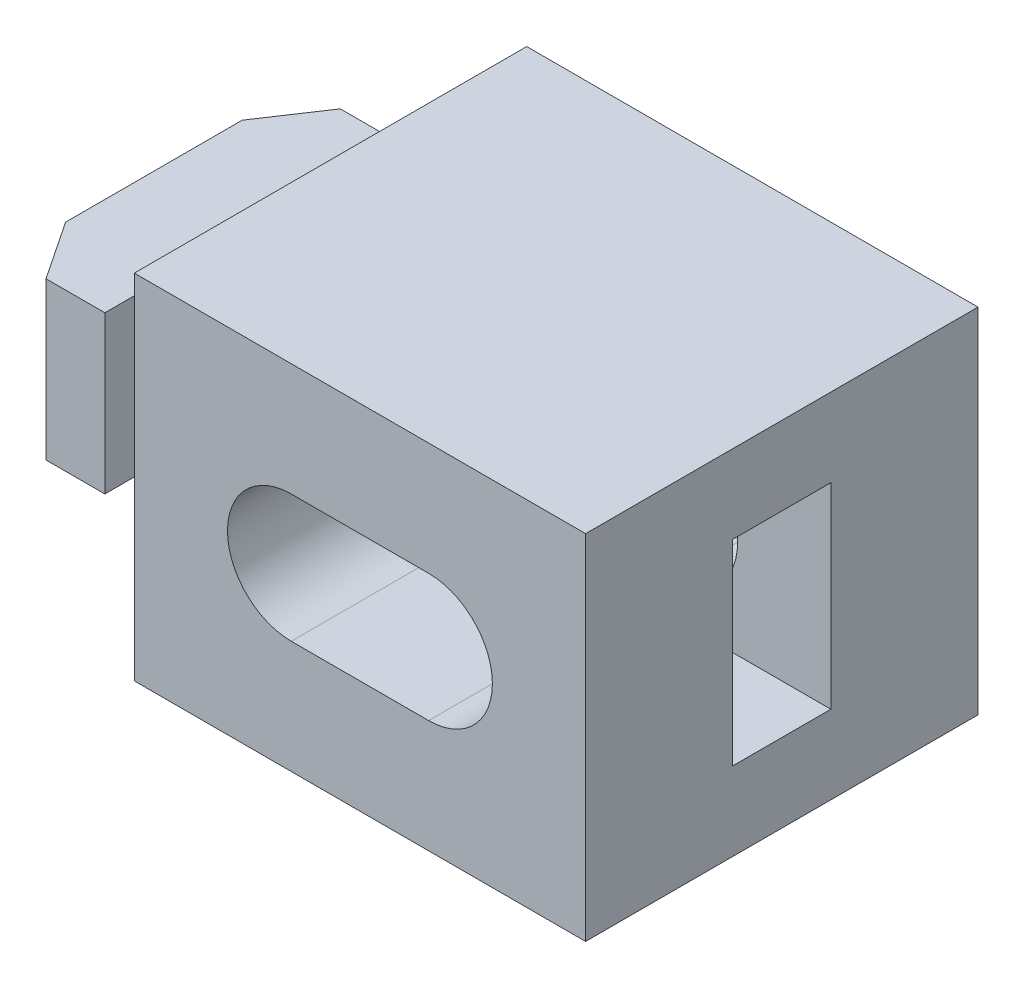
ISO-10303-21;
HEADER;
FILE_DESCRIPTION(('STEP AP214'),'2;1');
FILE_NAME('part.step','',(''),(''),'','','');
FILE_SCHEMA(('AUTOMOTIVE_DESIGN { 1 0 10303 214 1 1 1 1 }'));
ENDSEC;
DATA;
#1=APPLICATION_CONTEXT('core data for automotive mechanical design processes');
#2=APPLICATION_PROTOCOL_DEFINITION('international standard','automotive_design',2000,#1);
#3=PRODUCT_CONTEXT('',#1,'mechanical');
#4=PRODUCT('Part','Part','',(#3));
#5=PRODUCT_RELATED_PRODUCT_CATEGORY('part','',(#4));
#6=PRODUCT_DEFINITION_FORMATION('','',#4);
#7=PRODUCT_DEFINITION_CONTEXT('part definition',#1,'design');
#8=PRODUCT_DEFINITION('design','',#6,#7);
#9=PRODUCT_DEFINITION_SHAPE('','',#8);
#10=(LENGTH_UNIT() NAMED_UNIT(*) SI_UNIT(.MILLI.,.METRE.));
#11=(NAMED_UNIT(*) PLANE_ANGLE_UNIT() SI_UNIT($,.RADIAN.));
#12=(NAMED_UNIT(*) SI_UNIT($,.STERADIAN.) SOLID_ANGLE_UNIT());
#13=UNCERTAINTY_MEASURE_WITH_UNIT(LENGTH_MEASURE(1.E-05),#10,'distance_accuracy_value','');
#14=(GEOMETRIC_REPRESENTATION_CONTEXT(3) GLOBAL_UNCERTAINTY_ASSIGNED_CONTEXT((#13)) GLOBAL_UNIT_ASSIGNED_CONTEXT((#10,
#11,#12)) REPRESENTATION_CONTEXT('',''));
#15=CARTESIAN_POINT('',(0.,0.,0.));
#16=DIRECTION('',(0.,0.,1.));
#17=DIRECTION('',(1.,0.,0.));
#18=AXIS2_PLACEMENT_3D('',#15,#16,#17);
#19=CARTESIAN_POINT('',(-20.5,-4.,-7.5));
#20=DIRECTION('',(0.,1.,0.));
#21=DIRECTION('',(-1.,0.,0.));
#22=AXIS2_PLACEMENT_3D('',#19,#20,#21);
#23=PLANE('',#22);
#24=DIRECTION('',(0.55470019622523,0.,-0.832050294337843));
#25=VECTOR('',#24,1.);
#26=CARTESIAN_POINT('',(-20.5,-4.,-4.5));
#27=LINE('',#26,#25);
#28=CARTESIAN_POINT('',(-20.5,-4.,-4.5));
#29=VERTEX_POINT('',#28);
#30=CARTESIAN_POINT('',(-18.5,-4.,-7.5));
#31=VERTEX_POINT('',#30);
#32=EDGE_CURVE('E49',#29,#31,#27,.T.);
#33=ORIENTED_EDGE('',*,*,#32,.T.);
#34=DIRECTION('',(1.,0.,0.));
#35=VECTOR('',#34,1.);
#36=CARTESIAN_POINT('',(-20.5,-4.,-7.5));
#37=LINE('',#36,#35);
#38=CARTESIAN_POINT('',(-15.5,-4.,-7.5));
#39=VERTEX_POINT('',#38);
#40=EDGE_CURVE('E227',#31,#39,#37,.T.);
#41=ORIENTED_EDGE('',*,*,#40,.T.);
#42=DIRECTION('',(0.,0.,1.));
#43=VECTOR('',#42,1.);
#44=CARTESIAN_POINT('',(-15.5,-4.,-7.5));
#45=LINE('',#44,#43);
#46=CARTESIAN_POINT('',(-15.5,-4.,-0.999999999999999));
#47=VERTEX_POINT('',#46);
#48=EDGE_CURVE('E393',#39,#47,#45,.T.);
#49=ORIENTED_EDGE('',*,*,#48,.T.);
#50=DIRECTION('',(-1.,0.,0.));
#51=VECTOR('',#50,1.);
#52=CARTESIAN_POINT('',(-20.5,-4.,-0.999999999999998));
#53=LINE('',#52,#51);
#54=CARTESIAN_POINT('',(-11.5,-4.,-1.));
#55=VERTEX_POINT('',#54);
#56=EDGE_CURVE('E365',#47,#55,#53,.F.);
#57=ORIENTED_EDGE('',*,*,#56,.T.);
#58=DIRECTION('',(0.,0.,1.));
#59=VECTOR('',#58,1.);
#60=CARTESIAN_POINT('',(-11.5,-4.,-7.5));
#61=LINE('',#60,#59);
#62=CARTESIAN_POINT('',(-11.5,-4.,4.));
#63=VERTEX_POINT('',#62);
#64=EDGE_CURVE('E422',#55,#63,#61,.T.);
#65=ORIENTED_EDGE('',*,*,#64,.T.);
#66=DIRECTION('',(-1.,0.,0.));
#67=VECTOR('',#66,1.);
#68=CARTESIAN_POINT('',(-11.5,-4.,4.));
#69=LINE('',#68,#67);
#70=CARTESIAN_POINT('',(-15.5,-4.,4.));
#71=VERTEX_POINT('',#70);
#72=EDGE_CURVE('E408',#63,#71,#69,.T.);
#73=ORIENTED_EDGE('',*,*,#72,.T.);
#74=DIRECTION('',(0.,0.,-1.));
#75=VECTOR('',#74,1.);
#76=CARTESIAN_POINT('',(-15.5,-4.,7.5));
#77=LINE('',#76,#75);
#78=CARTESIAN_POINT('',(-15.5,-4.,7.5));
#79=VERTEX_POINT('',#78);
#80=EDGE_CURVE('E411',#79,#71,#77,.T.);
#81=ORIENTED_EDGE('',*,*,#80,.F.);
#82=DIRECTION('',(1.,0.,0.));
#83=VECTOR('',#82,1.);
#84=CARTESIAN_POINT('',(-20.5,-4.,7.5));
#85=LINE('',#84,#83);
#86=CARTESIAN_POINT('',(-18.5,-4.,7.5));
#87=VERTEX_POINT('',#86);
#88=EDGE_CURVE('E237',#87,#79,#85,.T.);
#89=ORIENTED_EDGE('',*,*,#88,.F.);
#90=DIRECTION('',(0.55470019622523,0.,0.832050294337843));
#91=VECTOR('',#90,1.);
#92=CARTESIAN_POINT('',(-20.5,-4.,4.5));
#93=LINE('',#92,#91);
#94=CARTESIAN_POINT('',(-20.5,-4.,4.5));
#95=VERTEX_POINT('',#94);
#96=EDGE_CURVE('E377',#95,#87,#93,.T.);
#97=ORIENTED_EDGE('',*,*,#96,.F.);
#98=DIRECTION('',(0.,0.,1.));
#99=VECTOR('',#98,1.);
#100=CARTESIAN_POINT('',(-20.5,-4.,-7.5));
#101=LINE('',#100,#99);
#102=EDGE_CURVE('E230',#29,#95,#101,.T.);
#103=ORIENTED_EDGE('',*,*,#102,.F.);
#104=EDGE_LOOP('',(#33,#41,#49,#57,#65,#73,#81,#89,#97,#103));
#105=FACE_BOUND('',#104,.T.);
#106=ADVANCED_FACE('F34',(#105),#23,.F.);
#107=CARTESIAN_POINT('',(-20.5,4.,-7.5));
#108=DIRECTION('',(0.,-1.,0.));
#109=DIRECTION('',(1.,0.,0.));
#110=AXIS2_PLACEMENT_3D('',#107,#108,#109);
#111=PLANE('',#110);
#112=DIRECTION('',(0.55470019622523,0.,-0.832050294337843));
#113=VECTOR('',#112,1.);
#114=CARTESIAN_POINT('',(-19.1153846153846,4.,-6.57692307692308));
#115=LINE('',#114,#113);
#116=CARTESIAN_POINT('',(-20.5,4.,-4.5));
#117=VERTEX_POINT('',#116);
#118=CARTESIAN_POINT('',(-18.5,4.,-7.5));
#119=VERTEX_POINT('',#118);
#120=EDGE_CURVE('E220',#117,#119,#115,.T.);
#121=ORIENTED_EDGE('',*,*,#120,.F.);
#122=DIRECTION('',(0.,0.,-1.));
#123=VECTOR('',#122,1.);
#124=CARTESIAN_POINT('',(-20.5,4.,-7.5));
#125=LINE('',#124,#123);
#126=CARTESIAN_POINT('',(-20.5,3.99999999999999,4.5));
#127=VERTEX_POINT('',#126);
#128=EDGE_CURVE('E424',#127,#117,#125,.T.);
#129=ORIENTED_EDGE('',*,*,#128,.F.);
#130=DIRECTION('',(0.55470019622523,0.,0.832050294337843));
#131=VECTOR('',#130,1.);
#132=CARTESIAN_POINT('',(-26.0384615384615,3.99999999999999,-3.8076923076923));
#133=LINE('',#132,#131);
#134=CARTESIAN_POINT('',(-18.5,4.,7.5));
#135=VERTEX_POINT('',#134);
#136=EDGE_CURVE('E56',#127,#135,#133,.T.);
#137=ORIENTED_EDGE('',*,*,#136,.T.);
#138=DIRECTION('',(1.,0.,0.));
#139=VECTOR('',#138,1.);
#140=CARTESIAN_POINT('',(-20.5,3.99999999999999,7.5));
#141=LINE('',#140,#139);
#142=CARTESIAN_POINT('',(-15.5,4.,7.5));
#143=VERTEX_POINT('',#142);
#144=EDGE_CURVE('E241',#135,#143,#141,.T.);
#145=ORIENTED_EDGE('',*,*,#144,.T.);
#146=DIRECTION('',(0.,0.,1.));
#147=VECTOR('',#146,1.);
#148=CARTESIAN_POINT('',(-15.5,4.,7.5));
#149=LINE('',#148,#147);
#150=CARTESIAN_POINT('',(-15.5,4.,1.));
#151=VERTEX_POINT('',#150);
#152=EDGE_CURVE('E405',#151,#143,#149,.T.);
#153=ORIENTED_EDGE('',*,*,#152,.F.);
#154=DIRECTION('',(1.,0.,0.));
#155=VECTOR('',#154,1.);
#156=CARTESIAN_POINT('',(-11.5,4.,1.));
#157=LINE('',#156,#155);
#158=CARTESIAN_POINT('',(-11.5,4.,1.));
#159=VERTEX_POINT('',#158);
#160=EDGE_CURVE('E357',#151,#159,#157,.T.);
#161=ORIENTED_EDGE('',*,*,#160,.T.);
#162=DIRECTION('',(0.,0.,-1.));
#163=VECTOR('',#162,1.);
#164=CARTESIAN_POINT('',(-11.5,4.,-7.5));
#165=LINE('',#164,#163);
#166=CARTESIAN_POINT('',(-11.5,4.,-4.));
#167=VERTEX_POINT('',#166);
#168=EDGE_CURVE('E425',#159,#167,#165,.T.);
#169=ORIENTED_EDGE('',*,*,#168,.T.);
#170=DIRECTION('',(1.,0.,0.));
#171=VECTOR('',#170,1.);
#172=CARTESIAN_POINT('',(-11.5,4.,-4.));
#173=LINE('',#172,#171);
#174=CARTESIAN_POINT('',(-15.5,4.,-4.));
#175=VERTEX_POINT('',#174);
#176=EDGE_CURVE('E402',#175,#167,#173,.T.);
#177=ORIENTED_EDGE('',*,*,#176,.F.);
#178=DIRECTION('',(0.,0.,-1.));
#179=VECTOR('',#178,1.);
#180=CARTESIAN_POINT('',(-15.5,4.,-7.5));
#181=LINE('',#180,#179);
#182=CARTESIAN_POINT('',(-15.5,4.,-7.5));
#183=VERTEX_POINT('',#182);
#184=EDGE_CURVE('E390',#175,#183,#181,.T.);
#185=ORIENTED_EDGE('',*,*,#184,.T.);
#186=DIRECTION('',(1.,0.,0.));
#187=VECTOR('',#186,1.);
#188=CARTESIAN_POINT('',(-20.5,4.,-7.5));
#189=LINE('',#188,#187);
#190=EDGE_CURVE('E427',#119,#183,#189,.T.);
#191=ORIENTED_EDGE('',*,*,#190,.F.);
#192=EDGE_LOOP('',(#121,#129,#137,#145,#153,#161,#169,#177,#185,#191));
#193=FACE_BOUND('',#192,.T.);
#194=ADVANCED_FACE('F432',(#193),#111,.F.);
#195=CARTESIAN_POINT('',(-20.5,4.,-7.5));
#196=DIRECTION('',(0.,0.,1.));
#197=DIRECTION('',(0.,-1.,0.));
#198=AXIS2_PLACEMENT_3D('',#195,#196,#197);
#199=PLANE('',#198);
#200=DIRECTION('',(0.,-1.,0.));
#201=VECTOR('',#200,1.);
#202=CARTESIAN_POINT('',(-18.5,5.,-7.5));
#203=LINE('',#202,#201);
#204=EDGE_CURVE('E217',#119,#31,#203,.T.);
#205=ORIENTED_EDGE('',*,*,#204,.F.);
#206=ORIENTED_EDGE('',*,*,#190,.T.);
#207=DIRECTION('',(0.,-1.,0.));
#208=VECTOR('',#207,1.);
#209=CARTESIAN_POINT('',(-15.5,9.001,-7.5));
#210=LINE('',#209,#208);
#211=EDGE_CURVE('E235',#183,#39,#210,.T.);
#212=ORIENTED_EDGE('',*,*,#211,.T.);
#213=ORIENTED_EDGE('',*,*,#40,.F.);
#214=EDGE_LOOP('',(#205,#206,#212,#213));
#215=FACE_BOUND('',#214,.T.);
#216=ADVANCED_FACE('F233',(#215),#199,.F.);
#217=CARTESIAN_POINT('',(-20.5,0.,0.));
#218=DIRECTION('',(-1.,0.,0.));
#219=DIRECTION('',(0.,0.,1.));
#220=AXIS2_PLACEMENT_3D('',#217,#218,#219);
#221=PLANE('',#220);
#222=ORIENTED_EDGE('',*,*,#128,.T.);
#223=DIRECTION('',(0.,-1.,0.));
#224=VECTOR('',#223,1.);
#225=CARTESIAN_POINT('',(-20.5,0.,-4.5));
#226=LINE('',#225,#224);
#227=EDGE_CURVE('E11',#117,#29,#226,.T.);
#228=ORIENTED_EDGE('',*,*,#227,.T.);
#229=ORIENTED_EDGE('',*,*,#102,.T.);
#230=DIRECTION('',(0.,-1.,0.));
#231=VECTOR('',#230,1.);
#232=CARTESIAN_POINT('',(-20.5,0.,4.5));
#233=LINE('',#232,#231);
#234=EDGE_CURVE('E42',#127,#95,#233,.T.);
#235=ORIENTED_EDGE('',*,*,#234,.F.);
#236=EDGE_LOOP('',(#222,#228,#229,#235));
#237=FACE_BOUND('',#236,.T.);
#238=ADVANCED_FACE('F462',(#237),#221,.T.);
#239=CARTESIAN_POINT('',(-11.5,9.,10.));
#240=DIRECTION('',(1.,0.,0.));
#241=DIRECTION('',(0.,1.,0.));
#242=AXIS2_PLACEMENT_3D('',#239,#240,#241);
#243=PLANE('',#242);
#244=ORIENTED_EDGE('',*,*,#64,.F.);
#245=CARTESIAN_POINT('',(-11.5,-1.,-1.));
#246=DIRECTION('',(1.,0.,0.));
#247=DIRECTION('',(0.,1.,0.));
#248=AXIS2_PLACEMENT_3D('',#245,#246,#247);
#249=CIRCLE('',#248,3.);
#250=CARTESIAN_POINT('',(-11.5,-1.,-4.));
#251=VERTEX_POINT('',#250);
#252=EDGE_CURVE('E375',#55,#251,#249,.T.);
#253=ORIENTED_EDGE('',*,*,#252,.T.);
#254=DIRECTION('',(0.,-1.,0.));
#255=VECTOR('',#254,1.);
#256=CARTESIAN_POINT('',(-11.5,9.001,-4.));
#257=LINE('',#256,#255);
#258=EDGE_CURVE('E395',#167,#251,#257,.T.);
#259=ORIENTED_EDGE('',*,*,#258,.F.);
#260=ORIENTED_EDGE('',*,*,#168,.F.);
#261=CARTESIAN_POINT('',(-11.5,0.999999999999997,1.));
#262=DIRECTION('',(1.,0.,0.));
#263=DIRECTION('',(0.,1.,0.));
#264=AXIS2_PLACEMENT_3D('',#261,#262,#263);
#265=CIRCLE('',#264,3.);
#266=CARTESIAN_POINT('',(-11.5,0.999999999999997,4.));
#267=VERTEX_POINT('',#266);
#268=EDGE_CURVE('E367',#159,#267,#265,.T.);
#269=ORIENTED_EDGE('',*,*,#268,.T.);
#270=DIRECTION('',(0.,-1.,0.));
#271=VECTOR('',#270,1.);
#272=CARTESIAN_POINT('',(-11.5,9.001,4.));
#273=LINE('',#272,#271);
#274=EDGE_CURVE('E419',#267,#63,#273,.T.);
#275=ORIENTED_EDGE('',*,*,#274,.T.);
#276=EDGE_LOOP('',(#244,#253,#259,#260,#269,#275));
#277=FACE_BOUND('',#276,.T.);
#278=DIRECTION('',(0.,-1.,0.));
#279=VECTOR('',#278,1.);
#280=CARTESIAN_POINT('',(-11.5,9.,-10.));
#281=LINE('',#280,#279);
#282=CARTESIAN_POINT('',(-11.5,9.,-10.));
#283=VERTEX_POINT('',#282);
#284=CARTESIAN_POINT('',(-11.5,-9.,-10.));
#285=VERTEX_POINT('',#284);
#286=EDGE_CURVE('E323',#283,#285,#281,.T.);
#287=ORIENTED_EDGE('',*,*,#286,.T.);
#288=DIRECTION('',(0.,0.,-1.));
#289=VECTOR('',#288,1.);
#290=CARTESIAN_POINT('',(-11.5,-9.,10.));
#291=LINE('',#290,#289);
#292=CARTESIAN_POINT('',(-11.5,-9.,10.));
#293=VERTEX_POINT('',#292);
#294=EDGE_CURVE('E350',#293,#285,#291,.T.);
#295=ORIENTED_EDGE('',*,*,#294,.F.);
#296=DIRECTION('',(0.,-1.,0.));
#297=VECTOR('',#296,1.);
#298=CARTESIAN_POINT('',(-11.5,9.,10.));
#299=LINE('',#298,#297);
#300=CARTESIAN_POINT('',(-11.5,9.,10.));
#301=VERTEX_POINT('',#300);
#302=EDGE_CURVE('E324',#301,#293,#299,.T.);
#303=ORIENTED_EDGE('',*,*,#302,.F.);
#304=DIRECTION('',(0.,0.,-1.));
#305=VECTOR('',#304,1.);
#306=CARTESIAN_POINT('',(-11.5,9.,10.));
#307=LINE('',#306,#305);
#308=EDGE_CURVE('E334',#301,#283,#307,.T.);
#309=ORIENTED_EDGE('',*,*,#308,.T.);
#310=EDGE_LOOP('',(#287,#295,#303,#309));
#311=FACE_BOUND('',#310,.T.);
#312=ADVANCED_FACE('F519',(#277,#311),#243,.F.);
#313=CARTESIAN_POINT('',(-3.5,0.,10.));
#314=DIRECTION('',(0.,0.,-1.));
#315=DIRECTION('',(-1.,0.,0.));
#316=AXIS2_PLACEMENT_3D('',#313,#314,#315);
#317=CYLINDRICAL_SURFACE('',#316,3.25);
#318=CARTESIAN_POINT('',(-3.5,0.,2.5));
#319=DIRECTION('',(0.,0.,1.));
#320=DIRECTION('',(0.,-1.,0.));
#321=AXIS2_PLACEMENT_3D('',#318,#319,#320);
#322=CIRCLE('',#321,3.25);
#323=CARTESIAN_POINT('',(-3.5,3.25,2.5));
#324=VERTEX_POINT('',#323);
#325=CARTESIAN_POINT('',(-3.5,-3.25,2.5));
#326=VERTEX_POINT('',#325);
#327=EDGE_CURVE('E284',#324,#326,#322,.T.);
#328=ORIENTED_EDGE('',*,*,#327,.F.);
#329=DIRECTION('',(0.,0.,-1.));
#330=VECTOR('',#329,1.);
#331=CARTESIAN_POINT('',(-3.5,3.25,10.));
#332=LINE('',#331,#330);
#333=CARTESIAN_POINT('',(-3.5,3.25,10.));
#334=VERTEX_POINT('',#333);
#335=EDGE_CURVE('E308',#334,#324,#332,.T.);
#336=ORIENTED_EDGE('',*,*,#335,.F.);
#337=CARTESIAN_POINT('',(-3.5,0.,10.));
#338=DIRECTION('',(0.,0.,1.));
#339=DIRECTION('',(1.,0.,0.));
#340=AXIS2_PLACEMENT_3D('',#337,#338,#339);
#341=CIRCLE('',#340,3.25);
#342=CARTESIAN_POINT('',(-3.5,-3.25,10.));
#343=VERTEX_POINT('',#342);
#344=EDGE_CURVE('E287',#334,#343,#341,.T.);
#345=ORIENTED_EDGE('',*,*,#344,.T.);
#346=DIRECTION('',(0.,0.,-1.));
#347=VECTOR('',#346,1.);
#348=CARTESIAN_POINT('',(-3.5,-3.25,10.));
#349=LINE('',#348,#347);
#350=EDGE_CURVE('E320',#343,#326,#349,.T.);
#351=ORIENTED_EDGE('',*,*,#350,.T.);
#352=EDGE_LOOP('',(#328,#336,#345,#351));
#353=FACE_BOUND('',#352,.T.);
#354=ADVANCED_FACE('F499',(#353),#317,.F.);
#355=CARTESIAN_POINT('',(-3.5,-3.25,10.));
#356=DIRECTION('',(0.,1.,0.));
#357=DIRECTION('',(-1.,0.,0.));
#358=AXIS2_PLACEMENT_3D('',#355,#356,#357);
#359=PLANE('',#358);
#360=DIRECTION('',(1.,0.,0.));
#361=VECTOR('',#360,1.);
#362=CARTESIAN_POINT('',(-3.5,-3.25,2.5));
#363=LINE('',#362,#361);
#364=CARTESIAN_POINT('',(3.5,-3.25,2.5));
#365=VERTEX_POINT('',#364);
#366=EDGE_CURVE('E282',#326,#365,#363,.T.);
#367=ORIENTED_EDGE('',*,*,#366,.F.);
#368=ORIENTED_EDGE('',*,*,#350,.F.);
#369=DIRECTION('',(1.,0.,0.));
#370=VECTOR('',#369,1.);
#371=CARTESIAN_POINT('',(-3.5,-3.25,10.));
#372=LINE('',#371,#370);
#373=CARTESIAN_POINT('',(3.5,-3.25,10.));
#374=VERTEX_POINT('',#373);
#375=EDGE_CURVE('E289',#343,#374,#372,.T.);
#376=ORIENTED_EDGE('',*,*,#375,.T.);
#377=DIRECTION('',(0.,0.,-1.));
#378=VECTOR('',#377,1.);
#379=CARTESIAN_POINT('',(3.5,-3.25,10.));
#380=LINE('',#379,#378);
#381=EDGE_CURVE('E316',#374,#365,#380,.T.);
#382=ORIENTED_EDGE('',*,*,#381,.T.);
#383=EDGE_LOOP('',(#367,#368,#376,#382));
#384=FACE_BOUND('',#383,.T.);
#385=ADVANCED_FACE('F494',(#384),#359,.T.);
#386=CARTESIAN_POINT('',(3.5,0.,10.));
#387=DIRECTION('',(0.,0.,-1.));
#388=DIRECTION('',(-1.,0.,0.));
#389=AXIS2_PLACEMENT_3D('',#386,#387,#388);
#390=CYLINDRICAL_SURFACE('',#389,3.25);
#391=CARTESIAN_POINT('',(3.5,0.,2.5));
#392=DIRECTION('',(0.,0.,1.));
#393=DIRECTION('',(0.,-1.,0.));
#394=AXIS2_PLACEMENT_3D('',#391,#392,#393);
#395=CIRCLE('',#394,3.25);
#396=CARTESIAN_POINT('',(3.5,3.25,2.5));
#397=VERTEX_POINT('',#396);
#398=EDGE_CURVE('E280',#365,#397,#395,.T.);
#399=ORIENTED_EDGE('',*,*,#398,.F.);
#400=ORIENTED_EDGE('',*,*,#381,.F.);
#401=CARTESIAN_POINT('',(3.5,0.,10.));
#402=DIRECTION('',(0.,0.,1.));
#403=DIRECTION('',(1.,0.,0.));
#404=AXIS2_PLACEMENT_3D('',#401,#402,#403);
#405=CIRCLE('',#404,3.25);
#406=CARTESIAN_POINT('',(3.5,3.25,10.));
#407=VERTEX_POINT('',#406);
#408=EDGE_CURVE('E292',#374,#407,#405,.T.);
#409=ORIENTED_EDGE('',*,*,#408,.T.);
#410=DIRECTION('',(0.,0.,-1.));
#411=VECTOR('',#410,1.);
#412=CARTESIAN_POINT('',(3.5,3.25,10.));
#413=LINE('',#412,#411);
#414=EDGE_CURVE('E312',#407,#397,#413,.T.);
#415=ORIENTED_EDGE('',*,*,#414,.T.);
#416=EDGE_LOOP('',(#399,#400,#409,#415));
#417=FACE_BOUND('',#416,.T.);
#418=ADVANCED_FACE('F489',(#417),#390,.F.);
#419=CARTESIAN_POINT('',(-3.5,3.25,10.));
#420=DIRECTION('',(0.,-1.,0.));
#421=DIRECTION('',(1.,0.,0.));
#422=AXIS2_PLACEMENT_3D('',#419,#420,#421);
#423=PLANE('',#422);
#424=DIRECTION('',(-1.,0.,0.));
#425=VECTOR('',#424,1.);
#426=CARTESIAN_POINT('',(-3.5,3.25,2.5));
#427=LINE('',#426,#425);
#428=EDGE_CURVE('E355',#397,#324,#427,.T.);
#429=ORIENTED_EDGE('',*,*,#428,.F.);
#430=ORIENTED_EDGE('',*,*,#414,.F.);
#431=DIRECTION('',(-1.,0.,0.));
#432=VECTOR('',#431,1.);
#433=CARTESIAN_POINT('',(-3.5,3.25,10.));
#434=LINE('',#433,#432);
#435=EDGE_CURVE('E295',#407,#334,#434,.T.);
#436=ORIENTED_EDGE('',*,*,#435,.T.);
#437=ORIENTED_EDGE('',*,*,#335,.T.);
#438=EDGE_LOOP('',(#429,#430,#436,#437));
#439=FACE_BOUND('',#438,.T.);
#440=ADVANCED_FACE('F484',(#439),#423,.T.);
#441=CARTESIAN_POINT('',(0.,0.,10.));
#442=DIRECTION('',(0.,0.,1.));
#443=DIRECTION('',(1.,0.,0.));
#444=AXIS2_PLACEMENT_3D('',#441,#442,#443);
#445=PLANE('',#444);
#446=ORIENTED_EDGE('',*,*,#302,.T.);
#447=DIRECTION('',(1.,0.,0.));
#448=VECTOR('',#447,1.);
#449=CARTESIAN_POINT('',(-11.5,-9.,10.));
#450=LINE('',#449,#448);
#451=CARTESIAN_POINT('',(11.5,-9.,10.));
#452=VERTEX_POINT('',#451);
#453=EDGE_CURVE('E327',#293,#452,#450,.T.);
#454=ORIENTED_EDGE('',*,*,#453,.T.);
#455=DIRECTION('',(0.,1.,0.));
#456=VECTOR('',#455,1.);
#457=CARTESIAN_POINT('',(11.5,9.,10.));
#458=LINE('',#457,#456);
#459=CARTESIAN_POINT('',(11.5,9.,10.));
#460=VERTEX_POINT('',#459);
#461=EDGE_CURVE('E330',#452,#460,#458,.T.);
#462=ORIENTED_EDGE('',*,*,#461,.T.);
#463=DIRECTION('',(-1.,0.,0.));
#464=VECTOR('',#463,1.);
#465=CARTESIAN_POINT('',(-11.5,9.,10.));
#466=LINE('',#465,#464);
#467=EDGE_CURVE('E332',#460,#301,#466,.T.);
#468=ORIENTED_EDGE('',*,*,#467,.T.);
#469=EDGE_LOOP('',(#446,#454,#462,#468));
#470=FACE_BOUND('',#469,.T.);
#471=ORIENTED_EDGE('',*,*,#375,.F.);
#472=ORIENTED_EDGE('',*,*,#344,.F.);
#473=ORIENTED_EDGE('',*,*,#435,.F.);
#474=ORIENTED_EDGE('',*,*,#408,.F.);
#475=EDGE_LOOP('',(#471,#472,#473,#474));
#476=FACE_BOUND('',#475,.T.);
#477=ADVANCED_FACE('F500',(#470,#476),#445,.T.);
#478=CARTESIAN_POINT('',(0.,0.,-10.));
#479=DIRECTION('',(0.,0.,1.));
#480=DIRECTION('',(1.,0.,0.));
#481=AXIS2_PLACEMENT_3D('',#478,#479,#480);
#482=PLANE('',#481);
#483=ORIENTED_EDGE('',*,*,#286,.F.);
#484=DIRECTION('',(-1.,0.,0.));
#485=VECTOR('',#484,1.);
#486=CARTESIAN_POINT('',(-11.5,9.,-10.));
#487=LINE('',#486,#485);
#488=CARTESIAN_POINT('',(11.5,9.,-10.));
#489=VERTEX_POINT('',#488);
#490=EDGE_CURVE('E328',#489,#283,#487,.T.);
#491=ORIENTED_EDGE('',*,*,#490,.F.);
#492=DIRECTION('',(0.,1.,0.));
#493=VECTOR('',#492,1.);
#494=CARTESIAN_POINT('',(11.5,9.,-10.));
#495=LINE('',#494,#493);
#496=CARTESIAN_POINT('',(11.5,-9.,-10.));
#497=VERTEX_POINT('',#496);
#498=EDGE_CURVE('E339',#497,#489,#495,.T.);
#499=ORIENTED_EDGE('',*,*,#498,.F.);
#500=DIRECTION('',(1.,0.,0.));
#501=VECTOR('',#500,1.);
#502=CARTESIAN_POINT('',(-11.5,-9.,-10.));
#503=LINE('',#502,#501);
#504=EDGE_CURVE('E337',#285,#497,#503,.T.);
#505=ORIENTED_EDGE('',*,*,#504,.F.);
#506=EDGE_LOOP('',(#483,#491,#499,#505));
#507=FACE_BOUND('',#506,.T.);
#508=CARTESIAN_POINT('',(-3.5,0.,-10.));
#509=DIRECTION('',(0.,0.,1.));
#510=DIRECTION('',(1.,0.,0.));
#511=AXIS2_PLACEMENT_3D('',#508,#509,#510);
#512=CIRCLE('',#511,3.25);
#513=CARTESIAN_POINT('',(-3.5,3.25,-10.));
#514=VERTEX_POINT('',#513);
#515=CARTESIAN_POINT('',(-3.5,-3.25,-10.));
#516=VERTEX_POINT('',#515);
#517=EDGE_CURVE('E286',#514,#516,#512,.T.);
#518=ORIENTED_EDGE('',*,*,#517,.T.);
#519=DIRECTION('',(1.,0.,0.));
#520=VECTOR('',#519,1.);
#521=CARTESIAN_POINT('',(-3.5,-3.25,-10.));
#522=LINE('',#521,#520);
#523=CARTESIAN_POINT('',(3.5,-3.25,-10.));
#524=VERTEX_POINT('',#523);
#525=EDGE_CURVE('E300',#516,#524,#522,.T.);
#526=ORIENTED_EDGE('',*,*,#525,.T.);
#527=CARTESIAN_POINT('',(3.5,0.,-10.));
#528=DIRECTION('',(0.,0.,1.));
#529=DIRECTION('',(1.,0.,0.));
#530=AXIS2_PLACEMENT_3D('',#527,#528,#529);
#531=CIRCLE('',#530,3.25);
#532=CARTESIAN_POINT('',(3.5,3.25,-10.));
#533=VERTEX_POINT('',#532);
#534=EDGE_CURVE('E303',#524,#533,#531,.T.);
#535=ORIENTED_EDGE('',*,*,#534,.T.);
#536=DIRECTION('',(-1.,0.,0.));
#537=VECTOR('',#536,1.);
#538=CARTESIAN_POINT('',(-3.5,3.25,-10.));
#539=LINE('',#538,#537);
#540=EDGE_CURVE('E290',#533,#514,#539,.T.);
#541=ORIENTED_EDGE('',*,*,#540,.T.);
#542=EDGE_LOOP('',(#518,#526,#535,#541));
#543=FACE_BOUND('',#542,.T.);
#544=ADVANCED_FACE('F503',(#507,#543),#482,.F.);
#545=CARTESIAN_POINT('',(-11.5,-9.,10.));
#546=DIRECTION('',(0.,1.,0.));
#547=DIRECTION('',(-1.,0.,0.));
#548=AXIS2_PLACEMENT_3D('',#545,#546,#547);
#549=PLANE('',#548);
#550=ORIENTED_EDGE('',*,*,#504,.T.);
#551=DIRECTION('',(0.,0.,-1.));
#552=VECTOR('',#551,1.);
#553=CARTESIAN_POINT('',(11.5,-9.,10.));
#554=LINE('',#553,#552);
#555=EDGE_CURVE('E347',#452,#497,#554,.T.);
#556=ORIENTED_EDGE('',*,*,#555,.F.);
#557=ORIENTED_EDGE('',*,*,#453,.F.);
#558=ORIENTED_EDGE('',*,*,#294,.T.);
#559=EDGE_LOOP('',(#550,#556,#557,#558));
#560=FACE_BOUND('',#559,.T.);
#561=ADVANCED_FACE('F507',(#560),#549,.F.);
#562=CARTESIAN_POINT('',(11.5,9.,10.));
#563=DIRECTION('',(-1.,0.,0.));
#564=DIRECTION('',(0.,-1.,0.));
#565=AXIS2_PLACEMENT_3D('',#562,#563,#564);
#566=PLANE('',#565);
#567=DIRECTION('',(0.,0.,-1.));
#568=VECTOR('',#567,1.);
#569=CARTESIAN_POINT('',(11.5,-5.,2.5));
#570=LINE('',#569,#568);
#571=CARTESIAN_POINT('',(11.5,-5.,2.5));
#572=VERTEX_POINT('',#571);
#573=CARTESIAN_POINT('',(11.5,-5.,-2.5));
#574=VERTEX_POINT('',#573);
#575=EDGE_CURVE('E239',#572,#574,#570,.T.);
#576=ORIENTED_EDGE('',*,*,#575,.F.);
#577=DIRECTION('',(0.,-1.,0.));
#578=VECTOR('',#577,1.);
#579=CARTESIAN_POINT('',(11.5,5.,2.5));
#580=LINE('',#579,#578);
#581=CARTESIAN_POINT('',(11.5,5.,2.5));
#582=VERTEX_POINT('',#581);
#583=EDGE_CURVE('E236',#582,#572,#580,.T.);
#584=ORIENTED_EDGE('',*,*,#583,.F.);
#585=DIRECTION('',(0.,0.,1.));
#586=VECTOR('',#585,1.);
#587=CARTESIAN_POINT('',(11.5,5.,2.5));
#588=LINE('',#587,#586);
#589=CARTESIAN_POINT('',(11.5,5.,-2.5));
#590=VERTEX_POINT('',#589);
#591=EDGE_CURVE('E249',#590,#582,#588,.T.);
#592=ORIENTED_EDGE('',*,*,#591,.F.);
#593=DIRECTION('',(0.,1.,0.));
#594=VECTOR('',#593,1.);
#595=CARTESIAN_POINT('',(11.5,5.,-2.5));
#596=LINE('',#595,#594);
#597=EDGE_CURVE('E261',#574,#590,#596,.T.);
#598=ORIENTED_EDGE('',*,*,#597,.F.);
#599=EDGE_LOOP('',(#576,#584,#592,#598));
#600=FACE_BOUND('',#599,.T.);
#601=ORIENTED_EDGE('',*,*,#498,.T.);
#602=DIRECTION('',(0.,0.,-1.));
#603=VECTOR('',#602,1.);
#604=CARTESIAN_POINT('',(11.5,9.,10.));
#605=LINE('',#604,#603);
#606=EDGE_CURVE('E344',#460,#489,#605,.T.);
#607=ORIENTED_EDGE('',*,*,#606,.F.);
#608=ORIENTED_EDGE('',*,*,#461,.F.);
#609=ORIENTED_EDGE('',*,*,#555,.T.);
#610=EDGE_LOOP('',(#601,#607,#608,#609));
#611=FACE_BOUND('',#610,.T.);
#612=ADVANCED_FACE('F511',(#600,#611),#566,.F.);
#613=CARTESIAN_POINT('',(-11.5,9.,10.));
#614=DIRECTION('',(0.,-1.,0.));
#615=DIRECTION('',(1.,0.,0.));
#616=AXIS2_PLACEMENT_3D('',#613,#614,#615);
#617=PLANE('',#616);
#618=ORIENTED_EDGE('',*,*,#490,.T.);
#619=ORIENTED_EDGE('',*,*,#308,.F.);
#620=ORIENTED_EDGE('',*,*,#467,.F.);
#621=ORIENTED_EDGE('',*,*,#606,.T.);
#622=EDGE_LOOP('',(#618,#619,#620,#621));
#623=FACE_BOUND('',#622,.T.);
#624=ADVANCED_FACE('F497',(#623),#617,.F.);
#625=CARTESIAN_POINT('',(-3.5,0.,-2.5));
#626=DIRECTION('',(0.,0.,-1.));
#627=DIRECTION('',(0.,1.,0.));
#628=AXIS2_PLACEMENT_3D('',#625,#626,#627);
#629=CIRCLE('',#628,3.25);
#630=CARTESIAN_POINT('',(-3.5,-3.25,-2.5));
#631=VERTEX_POINT('',#630);
#632=CARTESIAN_POINT('',(-3.5,3.25,-2.5));
#633=VERTEX_POINT('',#632);
#634=EDGE_CURVE('E278',#631,#633,#629,.T.);
#635=ORIENTED_EDGE('',*,*,#634,.F.);
#636=EDGE_CURVE('E319',#631,#516,#349,.T.);
#637=ORIENTED_EDGE('',*,*,#636,.T.);
#638=ORIENTED_EDGE('',*,*,#517,.F.);
#639=EDGE_CURVE('E297',#633,#514,#332,.T.);
#640=ORIENTED_EDGE('',*,*,#639,.F.);
#641=EDGE_LOOP('',(#635,#637,#638,#640));
#642=FACE_BOUND('',#641,.T.);
#643=ADVANCED_FACE('F492',(#642),#317,.F.);
#644=DIRECTION('',(-1.,0.,0.));
#645=VECTOR('',#644,1.);
#646=CARTESIAN_POINT('',(-3.5,-3.25,-2.5));
#647=LINE('',#646,#645);
#648=CARTESIAN_POINT('',(3.5,-3.25,-2.5));
#649=VERTEX_POINT('',#648);
#650=EDGE_CURVE('E276',#649,#631,#647,.T.);
#651=ORIENTED_EDGE('',*,*,#650,.F.);
#652=EDGE_CURVE('E315',#649,#524,#380,.T.);
#653=ORIENTED_EDGE('',*,*,#652,.T.);
#654=ORIENTED_EDGE('',*,*,#525,.F.);
#655=ORIENTED_EDGE('',*,*,#636,.F.);
#656=EDGE_LOOP('',(#651,#653,#654,#655));
#657=FACE_BOUND('',#656,.T.);
#658=ADVANCED_FACE('F487',(#657),#359,.T.);
#659=CARTESIAN_POINT('',(3.5,0.,-2.5));
#660=DIRECTION('',(0.,0.,-1.));
#661=DIRECTION('',(0.,1.,0.));
#662=AXIS2_PLACEMENT_3D('',#659,#660,#661);
#663=CIRCLE('',#662,3.25);
#664=CARTESIAN_POINT('',(3.5,3.25,-2.5));
#665=VERTEX_POINT('',#664);
#666=EDGE_CURVE('E268',#665,#649,#663,.T.);
#667=ORIENTED_EDGE('',*,*,#666,.F.);
#668=EDGE_CURVE('E311',#665,#533,#413,.T.);
#669=ORIENTED_EDGE('',*,*,#668,.T.);
#670=ORIENTED_EDGE('',*,*,#534,.F.);
#671=ORIENTED_EDGE('',*,*,#652,.F.);
#672=EDGE_LOOP('',(#667,#669,#670,#671));
#673=FACE_BOUND('',#672,.T.);
#674=ADVANCED_FACE('F482',(#673),#390,.F.);
#675=DIRECTION('',(1.,0.,0.));
#676=VECTOR('',#675,1.);
#677=CARTESIAN_POINT('',(-3.5,3.25,-2.5));
#678=LINE('',#677,#676);
#679=EDGE_CURVE('E353',#633,#665,#678,.T.);
#680=ORIENTED_EDGE('',*,*,#679,.F.);
#681=ORIENTED_EDGE('',*,*,#639,.T.);
#682=ORIENTED_EDGE('',*,*,#540,.F.);
#683=ORIENTED_EDGE('',*,*,#668,.F.);
#684=EDGE_LOOP('',(#680,#681,#682,#683));
#685=FACE_BOUND('',#684,.T.);
#686=ADVANCED_FACE('F478',(#685),#423,.T.);
#687=CARTESIAN_POINT('',(-8.5,5.,2.5));
#688=DIRECTION('',(0.,0.,1.));
#689=DIRECTION('',(0.,-1.,0.));
#690=AXIS2_PLACEMENT_3D('',#687,#688,#689);
#691=PLANE('',#690);
#692=ORIENTED_EDGE('',*,*,#327,.T.);
#693=ORIENTED_EDGE('',*,*,#366,.T.);
#694=ORIENTED_EDGE('',*,*,#398,.T.);
#695=ORIENTED_EDGE('',*,*,#428,.T.);
#696=EDGE_LOOP('',(#692,#693,#694,#695));
#697=FACE_BOUND('',#696,.T.);
#698=ORIENTED_EDGE('',*,*,#583,.T.);
#699=DIRECTION('',(1.,0.,0.));
#700=VECTOR('',#699,1.);
#701=CARTESIAN_POINT('',(-8.5,-5.,2.5));
#702=LINE('',#701,#700);
#703=CARTESIAN_POINT('',(-8.5,-5.,2.5));
#704=VERTEX_POINT('',#703);
#705=EDGE_CURVE('E257',#704,#572,#702,.T.);
#706=ORIENTED_EDGE('',*,*,#705,.F.);
#707=DIRECTION('',(0.,-1.,0.));
#708=VECTOR('',#707,1.);
#709=CARTESIAN_POINT('',(-8.5,5.,2.5));
#710=LINE('',#709,#708);
#711=CARTESIAN_POINT('',(-8.5,5.,2.5));
#712=VERTEX_POINT('',#711);
#713=EDGE_CURVE('E245',#712,#704,#710,.T.);
#714=ORIENTED_EDGE('',*,*,#713,.F.);
#715=DIRECTION('',(1.,0.,0.));
#716=VECTOR('',#715,1.);
#717=CARTESIAN_POINT('',(-8.5,5.,2.5));
#718=LINE('',#717,#716);
#719=EDGE_CURVE('E266',#712,#582,#718,.T.);
#720=ORIENTED_EDGE('',*,*,#719,.T.);
#721=EDGE_LOOP('',(#698,#706,#714,#720));
#722=FACE_BOUND('',#721,.T.);
#723=ADVANCED_FACE('F468',(#697,#722),#691,.F.);
#724=CARTESIAN_POINT('',(-8.5,5.,2.5));
#725=DIRECTION('',(0.,1.,0.));
#726=DIRECTION('',(-1.,0.,0.));
#727=AXIS2_PLACEMENT_3D('',#724,#725,#726);
#728=PLANE('',#727);
#729=ORIENTED_EDGE('',*,*,#591,.T.);
#730=ORIENTED_EDGE('',*,*,#719,.F.);
#731=DIRECTION('',(0.,0.,1.));
#732=VECTOR('',#731,1.);
#733=CARTESIAN_POINT('',(-8.5,5.,2.5));
#734=LINE('',#733,#732);
#735=CARTESIAN_POINT('',(-8.5,5.,-2.5));
#736=VERTEX_POINT('',#735);
#737=EDGE_CURVE('E255',#736,#712,#734,.T.);
#738=ORIENTED_EDGE('',*,*,#737,.F.);
#739=DIRECTION('',(1.,0.,0.));
#740=VECTOR('',#739,1.);
#741=CARTESIAN_POINT('',(-8.5,5.,-2.5));
#742=LINE('',#741,#740);
#743=EDGE_CURVE('E269',#736,#590,#742,.T.);
#744=ORIENTED_EDGE('',*,*,#743,.T.);
#745=EDGE_LOOP('',(#729,#730,#738,#744));
#746=FACE_BOUND('',#745,.T.);
#747=ADVANCED_FACE('F464',(#746),#728,.F.);
#748=CARTESIAN_POINT('',(-8.5,5.,-2.5));
#749=DIRECTION('',(0.,0.,-1.));
#750=DIRECTION('',(0.,1.,0.));
#751=AXIS2_PLACEMENT_3D('',#748,#749,#750);
#752=PLANE('',#751);
#753=ORIENTED_EDGE('',*,*,#634,.T.);
#754=ORIENTED_EDGE('',*,*,#679,.T.);
#755=ORIENTED_EDGE('',*,*,#666,.T.);
#756=ORIENTED_EDGE('',*,*,#650,.T.);
#757=EDGE_LOOP('',(#753,#754,#755,#756));
#758=FACE_BOUND('',#757,.T.);
#759=ORIENTED_EDGE('',*,*,#597,.T.);
#760=ORIENTED_EDGE('',*,*,#743,.F.);
#761=DIRECTION('',(0.,1.,0.));
#762=VECTOR('',#761,1.);
#763=CARTESIAN_POINT('',(-8.5,5.,-2.5));
#764=LINE('',#763,#762);
#765=CARTESIAN_POINT('',(-8.5,-5.,-2.5));
#766=VERTEX_POINT('',#765);
#767=EDGE_CURVE('E252',#766,#736,#764,.T.);
#768=ORIENTED_EDGE('',*,*,#767,.F.);
#769=DIRECTION('',(1.,0.,0.));
#770=VECTOR('',#769,1.);
#771=CARTESIAN_POINT('',(-8.5,-5.,-2.5));
#772=LINE('',#771,#770);
#773=EDGE_CURVE('E271',#766,#574,#772,.T.);
#774=ORIENTED_EDGE('',*,*,#773,.T.);
#775=EDGE_LOOP('',(#759,#760,#768,#774));
#776=FACE_BOUND('',#775,.T.);
#777=ADVANCED_FACE('F467',(#758,#776),#752,.F.);
#778=CARTESIAN_POINT('',(-8.5,-5.,2.5));
#779=DIRECTION('',(0.,-1.,0.));
#780=DIRECTION('',(1.,0.,0.));
#781=AXIS2_PLACEMENT_3D('',#778,#779,#780);
#782=PLANE('',#781);
#783=ORIENTED_EDGE('',*,*,#575,.T.);
#784=ORIENTED_EDGE('',*,*,#773,.F.);
#785=DIRECTION('',(0.,0.,-1.));
#786=VECTOR('',#785,1.);
#787=CARTESIAN_POINT('',(-8.5,-5.,2.5));
#788=LINE('',#787,#786);
#789=EDGE_CURVE('E248',#704,#766,#788,.T.);
#790=ORIENTED_EDGE('',*,*,#789,.F.);
#791=ORIENTED_EDGE('',*,*,#705,.T.);
#792=EDGE_LOOP('',(#783,#784,#790,#791));
#793=FACE_BOUND('',#792,.T.);
#794=ADVANCED_FACE('F451',(#793),#782,.F.);
#795=CARTESIAN_POINT('',(-8.5,0.,0.));
#796=DIRECTION('',(1.,0.,0.));
#797=DIRECTION('',(0.,1.,0.));
#798=AXIS2_PLACEMENT_3D('',#795,#796,#797);
#799=PLANE('',#798);
#800=ORIENTED_EDGE('',*,*,#713,.T.);
#801=ORIENTED_EDGE('',*,*,#789,.T.);
#802=ORIENTED_EDGE('',*,*,#767,.T.);
#803=ORIENTED_EDGE('',*,*,#737,.T.);
#804=EDGE_LOOP('',(#800,#801,#802,#803));
#805=FACE_BOUND('',#804,.T.);
#806=ADVANCED_FACE('F443',(#805),#799,.T.);
#807=CARTESIAN_POINT('',(-20.5,3.99999999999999,7.5));
#808=DIRECTION('',(0.,0.,-1.));
#809=DIRECTION('',(0.,1.,0.));
#810=AXIS2_PLACEMENT_3D('',#807,#808,#809);
#811=PLANE('',#810);
#812=ORIENTED_EDGE('',*,*,#144,.F.);
#813=DIRECTION('',(0.,-1.,0.));
#814=VECTOR('',#813,1.);
#815=CARTESIAN_POINT('',(-18.5,5.,7.5));
#816=LINE('',#815,#814);
#817=EDGE_CURVE('E384',#135,#87,#816,.T.);
#818=ORIENTED_EDGE('',*,*,#817,.T.);
#819=ORIENTED_EDGE('',*,*,#88,.T.);
#820=DIRECTION('',(0.,-1.,0.));
#821=VECTOR('',#820,1.);
#822=CARTESIAN_POINT('',(-15.5,9.001,7.5));
#823=LINE('',#822,#821);
#824=EDGE_CURVE('E414',#143,#79,#823,.T.);
#825=ORIENTED_EDGE('',*,*,#824,.F.);
#826=EDGE_LOOP('',(#812,#818,#819,#825));
#827=FACE_BOUND('',#826,.T.);
#828=ADVANCED_FACE('F440',(#827),#811,.F.);
#829=CARTESIAN_POINT('',(-11.5,9.001,4.));
#830=DIRECTION('',(0.,0.,1.));
#831=DIRECTION('',(1.,0.,0.));
#832=AXIS2_PLACEMENT_3D('',#829,#830,#831);
#833=PLANE('',#832);
#834=ORIENTED_EDGE('',*,*,#274,.F.);
#835=DIRECTION('',(1.,0.,0.));
#836=VECTOR('',#835,1.);
#837=CARTESIAN_POINT('',(-15.5,0.999999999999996,4.));
#838=LINE('',#837,#836);
#839=CARTESIAN_POINT('',(-15.5,0.999999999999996,4.));
#840=VERTEX_POINT('',#839);
#841=EDGE_CURVE('E360',#267,#840,#838,.F.);
#842=ORIENTED_EDGE('',*,*,#841,.T.);
#843=DIRECTION('',(0.,-1.,0.));
#844=VECTOR('',#843,1.);
#845=CARTESIAN_POINT('',(-15.5,9.001,4.));
#846=LINE('',#845,#844);
#847=EDGE_CURVE('E417',#840,#71,#846,.T.);
#848=ORIENTED_EDGE('',*,*,#847,.T.);
#849=ORIENTED_EDGE('',*,*,#72,.F.);
#850=EDGE_LOOP('',(#834,#842,#848,#849));
#851=FACE_BOUND('',#850,.T.);
#852=ADVANCED_FACE('F442',(#851),#833,.T.);
#853=CARTESIAN_POINT('',(-15.5,9.001,7.5));
#854=DIRECTION('',(-1.,0.,0.));
#855=DIRECTION('',(0.,-1.,0.));
#856=AXIS2_PLACEMENT_3D('',#853,#854,#855);
#857=PLANE('',#856);
#858=ORIENTED_EDGE('',*,*,#152,.T.);
#859=ORIENTED_EDGE('',*,*,#824,.T.);
#860=ORIENTED_EDGE('',*,*,#80,.T.);
#861=ORIENTED_EDGE('',*,*,#847,.F.);
#862=CARTESIAN_POINT('',(-15.5,0.999999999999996,1.));
#863=DIRECTION('',(-1.,0.,0.));
#864=DIRECTION('',(0.,-1.,0.));
#865=AXIS2_PLACEMENT_3D('',#862,#863,#864);
#866=CIRCLE('',#865,3.);
#867=EDGE_CURVE('E369',#840,#151,#866,.T.);
#868=ORIENTED_EDGE('',*,*,#867,.T.);
#869=EDGE_LOOP('',(#858,#859,#860,#861,#868));
#870=FACE_BOUND('',#869,.T.);
#871=ADVANCED_FACE('F436',(#870),#857,.F.);
#872=CARTESIAN_POINT('',(-15.5,9.001,-7.5));
#873=DIRECTION('',(1.,0.,0.));
#874=DIRECTION('',(0.,1.,0.));
#875=AXIS2_PLACEMENT_3D('',#872,#873,#874);
#876=PLANE('',#875);
#877=DIRECTION('',(0.,-1.,0.));
#878=VECTOR('',#877,1.);
#879=CARTESIAN_POINT('',(-15.5,9.001,-4.));
#880=LINE('',#879,#878);
#881=CARTESIAN_POINT('',(-15.5,-1.,-4.));
#882=VERTEX_POINT('',#881);
#883=EDGE_CURVE('E398',#175,#882,#880,.T.);
#884=ORIENTED_EDGE('',*,*,#883,.T.);
#885=CARTESIAN_POINT('',(-15.5,-1.,-0.999999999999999));
#886=DIRECTION('',(1.,0.,0.));
#887=DIRECTION('',(0.,1.,0.));
#888=AXIS2_PLACEMENT_3D('',#885,#886,#887);
#889=CIRCLE('',#888,3.);
#890=EDGE_CURVE('E372',#882,#47,#889,.F.);
#891=ORIENTED_EDGE('',*,*,#890,.T.);
#892=ORIENTED_EDGE('',*,*,#48,.F.);
#893=ORIENTED_EDGE('',*,*,#211,.F.);
#894=ORIENTED_EDGE('',*,*,#184,.F.);
#895=EDGE_LOOP('',(#884,#891,#892,#893,#894));
#896=FACE_BOUND('',#895,.T.);
#897=ADVANCED_FACE('F531',(#896),#876,.T.);
#898=CARTESIAN_POINT('',(-11.5,9.001,-4.));
#899=DIRECTION('',(0.,0.,1.));
#900=DIRECTION('',(1.,0.,0.));
#901=AXIS2_PLACEMENT_3D('',#898,#899,#900);
#902=PLANE('',#901);
#903=ORIENTED_EDGE('',*,*,#258,.T.);
#904=DIRECTION('',(-1.,0.,0.));
#905=VECTOR('',#904,1.);
#906=CARTESIAN_POINT('',(-11.5,-1.,-4.));
#907=LINE('',#906,#905);
#908=EDGE_CURVE('E362',#251,#882,#907,.T.);
#909=ORIENTED_EDGE('',*,*,#908,.T.);
#910=ORIENTED_EDGE('',*,*,#883,.F.);
#911=ORIENTED_EDGE('',*,*,#176,.T.);
#912=EDGE_LOOP('',(#903,#909,#910,#911));
#913=FACE_BOUND('',#912,.T.);
#914=ADVANCED_FACE('F524',(#913),#902,.F.);
#915=CARTESIAN_POINT('',(-20.5,0.999999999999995,0.999999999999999));
#916=DIRECTION('',(-1.,0.,0.));
#917=DIRECTION('',(0.,0.,1.));
#918=AXIS2_PLACEMENT_3D('',#915,#916,#917);
#919=CYLINDRICAL_SURFACE('',#918,3.);
#920=ORIENTED_EDGE('',*,*,#867,.F.);
#921=ORIENTED_EDGE('',*,*,#841,.F.);
#922=ORIENTED_EDGE('',*,*,#268,.F.);
#923=ORIENTED_EDGE('',*,*,#160,.F.);
#924=EDGE_LOOP('',(#920,#921,#922,#923));
#925=FACE_BOUND('',#924,.T.);
#926=ADVANCED_FACE('F522',(#925),#919,.T.);
#927=CARTESIAN_POINT('',(-11.5,-1.,-1.));
#928=DIRECTION('',(-1.,0.,0.));
#929=DIRECTION('',(0.,0.,1.));
#930=AXIS2_PLACEMENT_3D('',#927,#928,#929);
#931=CYLINDRICAL_SURFACE('',#930,3.);
#932=ORIENTED_EDGE('',*,*,#252,.F.);
#933=ORIENTED_EDGE('',*,*,#56,.F.);
#934=ORIENTED_EDGE('',*,*,#890,.F.);
#935=ORIENTED_EDGE('',*,*,#908,.F.);
#936=EDGE_LOOP('',(#932,#933,#934,#935));
#937=FACE_BOUND('',#936,.T.);
#938=ADVANCED_FACE('F36',(#937),#931,.T.);
#939=CARTESIAN_POINT('',(-20.5,4.99999999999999,4.5));
#940=DIRECTION('',(0.832050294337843,0.,-0.55470019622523));
#941=DIRECTION('',(-0.55470019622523,0.,-0.832050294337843));
#942=AXIS2_PLACEMENT_3D('',#939,#940,#941);
#943=PLANE('',#942);
#944=ORIENTED_EDGE('',*,*,#234,.T.);
#945=ORIENTED_EDGE('',*,*,#96,.T.);
#946=ORIENTED_EDGE('',*,*,#817,.F.);
#947=ORIENTED_EDGE('',*,*,#136,.F.);
#948=EDGE_LOOP('',(#944,#945,#946,#947));
#949=FACE_BOUND('',#948,.T.);
#950=ADVANCED_FACE('F376',(#949),#943,.F.);
#951=CARTESIAN_POINT('',(-20.5,4.99999999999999,-4.5));
#952=DIRECTION('',(-0.832050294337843,0.,-0.55470019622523));
#953=DIRECTION('',(-0.55470019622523,0.,0.832050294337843));
#954=AXIS2_PLACEMENT_3D('',#951,#952,#953);
#955=PLANE('',#954);
#956=ORIENTED_EDGE('',*,*,#120,.T.);
#957=ORIENTED_EDGE('',*,*,#204,.T.);
#958=ORIENTED_EDGE('',*,*,#32,.F.);
#959=ORIENTED_EDGE('',*,*,#227,.F.);
#960=EDGE_LOOP('',(#956,#957,#958,#959));
#961=FACE_BOUND('',#960,.T.);
#962=ADVANCED_FACE('F218',(#961),#955,.T.);
#963=CLOSED_SHELL('',(#106,#194,#216,#238,#312,#354,#385,#418,#440,#477,#544,#561,#612,#624,
#643,#658,#674,#686,#723,#747,#777,#794,#806,#828,#852,#871,#897,#914,#926,#938,#950,#962));
#964=MANIFOLD_SOLID_BREP('B2',#963);
#965=ADVANCED_BREP_SHAPE_REPRESENTATION('',(#18,#964),#14);
#966=SHAPE_DEFINITION_REPRESENTATION(#9,#965);
ENDSEC;
END-ISO-10303-21;
